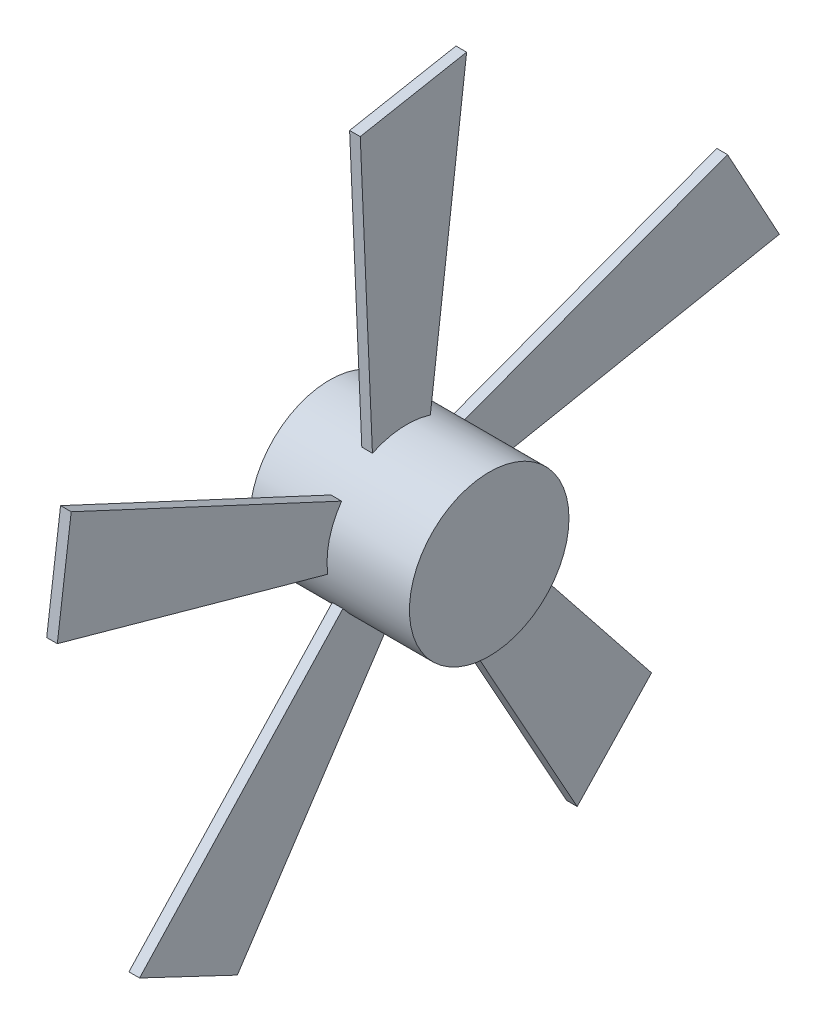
ISO-10303-21;
HEADER;
FILE_DESCRIPTION(('STEP AP214'),'2;1');
FILE_NAME('part.step','',(''),(''),'','','');
FILE_SCHEMA(('AUTOMOTIVE_DESIGN { 1 0 10303 214 1 1 1 1 }'));
ENDSEC;
DATA;
#1=APPLICATION_CONTEXT('core data for automotive mechanical design processes');
#2=APPLICATION_PROTOCOL_DEFINITION('international standard','automotive_design',2000,#1);
#3=PRODUCT_CONTEXT('',#1,'mechanical');
#4=PRODUCT('Part','Part','',(#3));
#5=PRODUCT_RELATED_PRODUCT_CATEGORY('part','',(#4));
#6=PRODUCT_DEFINITION_FORMATION('','',#4);
#7=PRODUCT_DEFINITION_CONTEXT('part definition',#1,'design');
#8=PRODUCT_DEFINITION('design','',#6,#7);
#9=PRODUCT_DEFINITION_SHAPE('','',#8);
#10=(LENGTH_UNIT() NAMED_UNIT(*) SI_UNIT(.MILLI.,.METRE.));
#11=(NAMED_UNIT(*) PLANE_ANGLE_UNIT() SI_UNIT($,.RADIAN.));
#12=(NAMED_UNIT(*) SI_UNIT($,.STERADIAN.) SOLID_ANGLE_UNIT());
#13=UNCERTAINTY_MEASURE_WITH_UNIT(LENGTH_MEASURE(1.E-05),#10,'distance_accuracy_value','');
#14=(GEOMETRIC_REPRESENTATION_CONTEXT(3) GLOBAL_UNCERTAINTY_ASSIGNED_CONTEXT((#13)) GLOBAL_UNIT_ASSIGNED_CONTEXT((#10,
#11,#12)) REPRESENTATION_CONTEXT('',''));
#15=CARTESIAN_POINT('',(0.,0.,0.));
#16=DIRECTION('',(0.,0.,1.));
#17=DIRECTION('',(1.,0.,0.));
#18=AXIS2_PLACEMENT_3D('',#15,#16,#17);
#19=CARTESIAN_POINT('',(30.48,0.,0.));
#20=DIRECTION('',(-1.,0.,0.));
#21=DIRECTION('',(0.,0.,1.));
#22=AXIS2_PLACEMENT_3D('',#19,#20,#21);
#23=CYLINDRICAL_SURFACE('',#22,15.24);
#24=CARTESIAN_POINT('',(14.732,0.,0.));
#25=DIRECTION('',(-1.,0.,0.));
#26=DIRECTION('',(0.,0.,1.));
#27=AXIS2_PLACEMENT_3D('',#24,#25,#26);
#28=CIRCLE('',#27,15.24);
#29=CARTESIAN_POINT('',(14.732,-7.27137485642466,-13.393457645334));
#30=VERTEX_POINT('',#29);
#31=CARTESIAN_POINT('',(14.732,-14.426123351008,-4.91371194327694));
#32=VERTEX_POINT('',#31);
#33=EDGE_CURVE('E392',#30,#32,#28,.T.);
#34=ORIENTED_EDGE('',*,*,#33,.F.);
#35=DIRECTION('',(-1.,0.,0.));
#36=VECTOR('',#35,1.);
#37=CARTESIAN_POINT('',(30.48,-7.27137485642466,-13.393457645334));
#38=LINE('',#37,#36);
#39=CARTESIAN_POINT('',(12.7,-7.27137485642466,-13.393457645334));
#40=VERTEX_POINT('',#39);
#41=EDGE_CURVE('E390',#40,#30,#38,.F.);
#42=ORIENTED_EDGE('',*,*,#41,.F.);
#43=CARTESIAN_POINT('',(12.7,0.,0.));
#44=DIRECTION('',(-1.,0.,0.));
#45=DIRECTION('',(0.,0.,1.));
#46=AXIS2_PLACEMENT_3D('',#43,#44,#45);
#47=CIRCLE('',#46,15.24);
#48=CARTESIAN_POINT('',(12.7,-14.426123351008,-4.91371194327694));
#49=VERTEX_POINT('',#48);
#50=EDGE_CURVE('E382',#40,#49,#47,.T.);
#51=ORIENTED_EDGE('',*,*,#50,.T.);
#52=DIRECTION('',(-1.,0.,0.));
#53=VECTOR('',#52,1.);
#54=CARTESIAN_POINT('',(30.48,-14.426123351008,-4.91371194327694));
#55=LINE('',#54,#53);
#56=EDGE_CURVE('E388',#32,#49,#55,.T.);
#57=ORIENTED_EDGE('',*,*,#56,.F.);
#58=EDGE_LOOP('',(#34,#42,#51,#57));
#59=FACE_BOUND('',#58,.T.);
#60=CARTESIAN_POINT('',(14.732,0.,0.));
#61=DIRECTION('',(-1.,0.,0.));
#62=DIRECTION('',(0.,0.,1.));
#63=AXIS2_PLACEMENT_3D('',#60,#61,#62);
#64=CIRCLE('',#63,15.24);
#65=CARTESIAN_POINT('',(14.732,-1.98981104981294,15.109541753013));
#66=VERTEX_POINT('',#65);
#67=CARTESIAN_POINT('',(14.732,8.78277153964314,12.4547390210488));
#68=VERTEX_POINT('',#67);
#69=EDGE_CURVE('E368',#66,#68,#64,.T.);
#70=ORIENTED_EDGE('',*,*,#69,.F.);
#71=DIRECTION('',(-1.,0.,0.));
#72=VECTOR('',#71,1.);
#73=CARTESIAN_POINT('',(30.48,-1.98981104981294,15.109541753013));
#74=LINE('',#73,#72);
#75=CARTESIAN_POINT('',(12.7,-1.98981104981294,15.109541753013));
#76=VERTEX_POINT('',#75);
#77=EDGE_CURVE('E356',#76,#66,#74,.F.);
#78=ORIENTED_EDGE('',*,*,#77,.F.);
#79=CARTESIAN_POINT('',(12.7,0.,0.));
#80=DIRECTION('',(-1.,0.,0.));
#81=DIRECTION('',(0.,0.,1.));
#82=AXIS2_PLACEMENT_3D('',#79,#80,#81);
#83=CIRCLE('',#82,15.24);
#84=CARTESIAN_POINT('',(12.7,8.78277153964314,12.4547390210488));
#85=VERTEX_POINT('',#84);
#86=EDGE_CURVE('E354',#76,#85,#83,.T.);
#87=ORIENTED_EDGE('',*,*,#86,.T.);
#88=DIRECTION('',(-1.,0.,0.));
#89=VECTOR('',#88,1.);
#90=CARTESIAN_POINT('',(30.48,8.78277153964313,12.4547390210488));
#91=LINE('',#90,#89);
#92=EDGE_CURVE('E362',#68,#85,#91,.T.);
#93=ORIENTED_EDGE('',*,*,#92,.F.);
#94=EDGE_LOOP('',(#70,#78,#87,#93));
#95=FACE_BOUND('',#94,.T.);
#96=CARTESIAN_POINT('',(0.,0.,0.));
#97=DIRECTION('',(1.,0.,0.));
#98=DIRECTION('',(0.,0.,-1.));
#99=AXIS2_PLACEMENT_3D('',#96,#97,#98);
#100=CIRCLE('',#99,15.24);
#101=CARTESIAN_POINT('',(0.,0.,-15.24));
#102=VERTEX_POINT('',#101);
#103=EDGE_CURVE('E334',#102,#102,#100,.T.);
#104=ORIENTED_EDGE('',*,*,#103,.T.);
#105=EDGE_LOOP('',(#104));
#106=FACE_BOUND('',#105,.T.);
#107=CARTESIAN_POINT('',(30.48,0.,0.));
#108=DIRECTION('',(1.,0.,0.));
#109=DIRECTION('',(0.,0.,-1.));
#110=AXIS2_PLACEMENT_3D('',#107,#108,#109);
#111=CIRCLE('',#110,15.24);
#112=CARTESIAN_POINT('',(30.48,0.,-15.24));
#113=VERTEX_POINT('',#112);
#114=EDGE_CURVE('E331',#113,#113,#111,.T.);
#115=ORIENTED_EDGE('',*,*,#114,.F.);
#116=EDGE_LOOP('',(#115));
#117=FACE_BOUND('',#116,.T.);
#118=CARTESIAN_POINT('',(14.732,0.,0.));
#119=DIRECTION('',(-1.,0.,0.));
#120=DIRECTION('',(0.,0.,1.));
#121=AXIS2_PLACEMENT_3D('',#118,#119,#120);
#122=CIRCLE('',#121,15.24);
#123=CARTESIAN_POINT('',(14.732,13.7551427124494,6.56152794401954));
#124=VERTEX_POINT('',#123);
#125=CARTESIAN_POINT('',(14.732,14.5591863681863,-4.50418608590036));
#126=VERTEX_POINT('',#125);
#127=EDGE_CURVE('E355',#124,#126,#122,.T.);
#128=ORIENTED_EDGE('',*,*,#127,.F.);
#129=DIRECTION('',(-1.,0.,0.));
#130=VECTOR('',#129,1.);
#131=CARTESIAN_POINT('',(30.48,13.7551427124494,6.56152794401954));
#132=LINE('',#131,#130);
#133=CARTESIAN_POINT('',(12.7,13.7551427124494,6.56152794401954));
#134=VERTEX_POINT('',#133);
#135=EDGE_CURVE('E344',#134,#124,#132,.F.);
#136=ORIENTED_EDGE('',*,*,#135,.F.);
#137=CARTESIAN_POINT('',(12.7,0.,0.));
#138=DIRECTION('',(-1.,0.,0.));
#139=DIRECTION('',(0.,0.,1.));
#140=AXIS2_PLACEMENT_3D('',#137,#138,#139);
#141=CIRCLE('',#140,15.24);
#142=CARTESIAN_POINT('',(12.7,14.5591863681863,-4.50418608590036));
#143=VERTEX_POINT('',#142);
#144=EDGE_CURVE('E337',#134,#143,#141,.T.);
#145=ORIENTED_EDGE('',*,*,#144,.T.);
#146=DIRECTION('',(-1.,0.,0.));
#147=VECTOR('',#146,1.);
#148=CARTESIAN_POINT('',(30.48,14.5591863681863,-4.50418608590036));
#149=LINE('',#148,#147);
#150=EDGE_CURVE('E346',#126,#143,#149,.T.);
#151=ORIENTED_EDGE('',*,*,#150,.F.);
#152=EDGE_LOOP('',(#128,#136,#145,#151));
#153=FACE_BOUND('',#152,.T.);
#154=CARTESIAN_POINT('',(14.732,0.,0.));
#155=DIRECTION('',(-1.,0.,0.));
#156=DIRECTION('',(0.,0.,1.));
#157=AXIS2_PLACEMENT_3D('',#154,#155,#156);
#158=CIRCLE('',#157,15.24);
#159=CARTESIAN_POINT('',(14.732,-14.9849135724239,2.77668241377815));
#160=VERTEX_POINT('',#159);
#161=CARTESIAN_POINT('',(14.732,-9.13113504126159,12.2016381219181));
#162=VERTEX_POINT('',#161);
#163=EDGE_CURVE('E379',#160,#162,#158,.T.);
#164=ORIENTED_EDGE('',*,*,#163,.F.);
#165=DIRECTION('',(-1.,0.,0.));
#166=VECTOR('',#165,1.);
#167=CARTESIAN_POINT('',(30.48,-14.9849135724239,2.77668241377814));
#168=LINE('',#167,#166);
#169=CARTESIAN_POINT('',(12.7,-14.9849135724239,2.77668241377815));
#170=VERTEX_POINT('',#169);
#171=EDGE_CURVE('E373',#170,#160,#168,.F.);
#172=ORIENTED_EDGE('',*,*,#171,.F.);
#173=CARTESIAN_POINT('',(12.7,0.,0.));
#174=DIRECTION('',(-1.,0.,0.));
#175=DIRECTION('',(0.,0.,1.));
#176=AXIS2_PLACEMENT_3D('',#173,#174,#175);
#177=CIRCLE('',#176,15.24);
#178=CARTESIAN_POINT('',(12.7,-9.13113504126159,12.2016381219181));
#179=VERTEX_POINT('',#178);
#180=EDGE_CURVE('E369',#170,#179,#177,.T.);
#181=ORIENTED_EDGE('',*,*,#180,.T.);
#182=DIRECTION('',(-1.,0.,0.));
#183=VECTOR('',#182,1.);
#184=CARTESIAN_POINT('',(30.48,-9.13113504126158,12.2016381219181));
#185=LINE('',#184,#183);
#186=EDGE_CURVE('E376',#162,#179,#185,.T.);
#187=ORIENTED_EDGE('',*,*,#186,.F.);
#188=EDGE_LOOP('',(#164,#172,#181,#187));
#189=FACE_BOUND('',#188,.T.);
#190=CARTESIAN_POINT('',(14.732,0.,0.));
#191=DIRECTION('',(-1.,0.,0.));
#192=DIRECTION('',(0.,0.,1.));
#193=AXIS2_PLACEMENT_3D('',#190,#191,#192);
#194=CIRCLE('',#193,15.24);
#195=CARTESIAN_POINT('',(14.732,10.4909567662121,-11.0542944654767));
#196=VERTEX_POINT('',#195);
#197=CARTESIAN_POINT('',(14.732,0.215300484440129,-15.2384791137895));
#198=VERTEX_POINT('',#197);
#199=EDGE_CURVE('E11',#196,#198,#194,.T.);
#200=ORIENTED_EDGE('',*,*,#199,.F.);
#201=DIRECTION('',(-1.,0.,0.));
#202=VECTOR('',#201,1.);
#203=CARTESIAN_POINT('',(30.48,10.4909567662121,-11.0542944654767));
#204=LINE('',#203,#202);
#205=CARTESIAN_POINT('',(12.7,10.4909567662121,-11.0542944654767));
#206=VERTEX_POINT('',#205);
#207=EDGE_CURVE('E399',#206,#196,#204,.F.);
#208=ORIENTED_EDGE('',*,*,#207,.F.);
#209=CARTESIAN_POINT('',(12.7,0.,0.));
#210=DIRECTION('',(-1.,0.,0.));
#211=DIRECTION('',(0.,0.,1.));
#212=AXIS2_PLACEMENT_3D('',#209,#210,#211);
#213=CIRCLE('',#212,15.24);
#214=CARTESIAN_POINT('',(12.7,0.215300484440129,-15.2384791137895));
#215=VERTEX_POINT('',#214);
#216=EDGE_CURVE('E398',#206,#215,#213,.T.);
#217=ORIENTED_EDGE('',*,*,#216,.T.);
#218=DIRECTION('',(-1.,0.,0.));
#219=VECTOR('',#218,1.);
#220=CARTESIAN_POINT('',(30.48,0.215300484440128,-15.2384791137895));
#221=LINE('',#220,#219);
#222=EDGE_CURVE('E54',#198,#215,#221,.T.);
#223=ORIENTED_EDGE('',*,*,#222,.F.);
#224=EDGE_LOOP('',(#200,#208,#217,#223));
#225=FACE_BOUND('',#224,.T.);
#226=ADVANCED_FACE('F50',(#59,#95,#106,#117,#153,#189,#225),#23,.T.);
#227=CARTESIAN_POINT('',(30.48,0.,0.));
#228=DIRECTION('',(1.,0.,0.));
#229=DIRECTION('',(0.,0.,-1.));
#230=AXIS2_PLACEMENT_3D('',#227,#228,#229);
#231=PLANE('',#230);
#232=ORIENTED_EDGE('',*,*,#114,.T.);
#233=EDGE_LOOP('',(#232));
#234=FACE_BOUND('',#233,.T.);
#235=ADVANCED_FACE('F425',(#234),#231,.T.);
#236=CARTESIAN_POINT('',(0.,0.,0.));
#237=DIRECTION('',(1.,0.,0.));
#238=DIRECTION('',(0.,0.,-1.));
#239=AXIS2_PLACEMENT_3D('',#236,#237,#238);
#240=PLANE('',#239);
#241=ORIENTED_EDGE('',*,*,#103,.F.);
#242=EDGE_LOOP('',(#241));
#243=FACE_BOUND('',#242,.T.);
#244=ADVANCED_FACE('F427',(#243),#240,.F.);
#245=CARTESIAN_POINT('',(14.732,8.89,-3.81));
#246=DIRECTION('',(0.,0.121541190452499,0.992586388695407));
#247=DIRECTION('',(0.,-0.992586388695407,0.121541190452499));
#248=AXIS2_PLACEMENT_3D('',#245,#246,#247);
#249=PLANE('',#248);
#250=DIRECTION('',(0.,0.992586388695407,-0.121541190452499));
#251=VECTOR('',#250,1.);
#252=CARTESIAN_POINT('',(14.732,8.89,-3.81));
#253=LINE('',#252,#251);
#254=CARTESIAN_POINT('',(14.732,71.12,-11.43));
#255=VERTEX_POINT('',#254);
#256=EDGE_CURVE('E308',#126,#255,#253,.T.);
#257=ORIENTED_EDGE('',*,*,#256,.F.);
#258=ORIENTED_EDGE('',*,*,#150,.T.);
#259=DIRECTION('',(0.,0.992586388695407,-0.121541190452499));
#260=VECTOR('',#259,1.);
#261=CARTESIAN_POINT('',(12.7,8.89,-3.81));
#262=LINE('',#261,#260);
#263=CARTESIAN_POINT('',(12.7,71.12,-11.43));
#264=VERTEX_POINT('',#263);
#265=EDGE_CURVE('E303',#143,#264,#262,.T.);
#266=ORIENTED_EDGE('',*,*,#265,.T.);
#267=DIRECTION('',(-1.,0.,0.));
#268=VECTOR('',#267,1.);
#269=CARTESIAN_POINT('',(14.732,71.12,-11.43));
#270=LINE('',#269,#268);
#271=EDGE_CURVE('E328',#255,#264,#270,.T.);
#272=ORIENTED_EDGE('',*,*,#271,.F.);
#273=EDGE_LOOP('',(#257,#258,#266,#272));
#274=FACE_BOUND('',#273,.T.);
#275=ADVANCED_FACE('F518',(#274),#249,.F.);
#276=CARTESIAN_POINT('',(14.732,67.31,8.89));
#277=DIRECTION('',(0.,0.0434372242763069,-0.99905615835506));
#278=DIRECTION('',(0.,0.99905615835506,0.0434372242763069));
#279=AXIS2_PLACEMENT_3D('',#276,#277,#278);
#280=PLANE('',#279);
#281=DIRECTION('',(0.,-0.99905615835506,-0.0434372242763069));
#282=VECTOR('',#281,1.);
#283=CARTESIAN_POINT('',(12.7,67.31,8.89));
#284=LINE('',#283,#282);
#285=CARTESIAN_POINT('',(12.7,67.31,8.89));
#286=VERTEX_POINT('',#285);
#287=EDGE_CURVE('E309',#286,#134,#284,.T.);
#288=ORIENTED_EDGE('',*,*,#287,.T.);
#289=ORIENTED_EDGE('',*,*,#135,.T.);
#290=DIRECTION('',(0.,-0.99905615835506,-0.0434372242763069));
#291=VECTOR('',#290,1.);
#292=CARTESIAN_POINT('',(14.732,67.31,8.89));
#293=LINE('',#292,#291);
#294=CARTESIAN_POINT('',(14.732,67.31,8.89));
#295=VERTEX_POINT('',#294);
#296=EDGE_CURVE('E311',#295,#124,#293,.T.);
#297=ORIENTED_EDGE('',*,*,#296,.F.);
#298=DIRECTION('',(-1.,0.,0.));
#299=VECTOR('',#298,1.);
#300=CARTESIAN_POINT('',(14.732,67.31,8.89));
#301=LINE('',#300,#299);
#302=EDGE_CURVE('E320',#295,#286,#301,.T.);
#303=ORIENTED_EDGE('',*,*,#302,.T.);
#304=EDGE_LOOP('',(#288,#289,#297,#303));
#305=FACE_BOUND('',#304,.T.);
#306=ADVANCED_FACE('F516',(#305),#280,.F.);
#307=CARTESIAN_POINT('',(14.732,71.12,-11.43));
#308=DIRECTION('',(0.,-0.982872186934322,-0.184288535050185));
#309=DIRECTION('',(0.,0.184288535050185,-0.982872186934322));
#310=AXIS2_PLACEMENT_3D('',#307,#308,#309);
#311=PLANE('',#310);
#312=DIRECTION('',(0.,-0.184288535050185,0.982872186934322));
#313=VECTOR('',#312,1.);
#314=CARTESIAN_POINT('',(12.7,71.12,-11.43));
#315=LINE('',#314,#313);
#316=EDGE_CURVE('E319',#264,#286,#315,.T.);
#317=ORIENTED_EDGE('',*,*,#316,.T.);
#318=ORIENTED_EDGE('',*,*,#302,.F.);
#319=DIRECTION('',(0.,-0.184288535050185,0.982872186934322));
#320=VECTOR('',#319,1.);
#321=CARTESIAN_POINT('',(14.732,71.12,-11.43));
#322=LINE('',#321,#320);
#323=EDGE_CURVE('E310',#255,#295,#322,.T.);
#324=ORIENTED_EDGE('',*,*,#323,.F.);
#325=ORIENTED_EDGE('',*,*,#271,.T.);
#326=EDGE_LOOP('',(#317,#318,#324,#325));
#327=FACE_BOUND('',#326,.T.);
#328=ADVANCED_FACE('F512',(#327),#311,.F.);
#329=CARTESIAN_POINT('',(14.732,0.,0.));
#330=DIRECTION('',(-1.,0.,0.));
#331=DIRECTION('',(0.,0.,1.));
#332=AXIS2_PLACEMENT_3D('',#329,#330,#331);
#333=PLANE('',#332);
#334=ORIENTED_EDGE('',*,*,#296,.T.);
#335=ORIENTED_EDGE('',*,*,#127,.T.);
#336=ORIENTED_EDGE('',*,*,#256,.T.);
#337=ORIENTED_EDGE('',*,*,#323,.T.);
#338=EDGE_LOOP('',(#334,#335,#336,#337));
#339=FACE_BOUND('',#338,.T.);
#340=ADVANCED_FACE('F506',(#339),#333,.F.);
#341=CARTESIAN_POINT('',(12.7,0.,0.));
#342=DIRECTION('',(-1.,0.,0.));
#343=DIRECTION('',(0.,0.,1.));
#344=AXIS2_PLACEMENT_3D('',#341,#342,#343);
#345=PLANE('',#344);
#346=ORIENTED_EDGE('',*,*,#144,.F.);
#347=ORIENTED_EDGE('',*,*,#287,.F.);
#348=ORIENTED_EDGE('',*,*,#316,.F.);
#349=ORIENTED_EDGE('',*,*,#265,.F.);
#350=EDGE_LOOP('',(#346,#347,#348,#349));
#351=FACE_BOUND('',#350,.T.);
#352=ADVANCED_FACE('F508',(#351),#345,.T.);
#353=CARTESIAN_POINT('',(14.732,6.37068640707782,7.27753768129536));
#354=DIRECTION('',(0.,-0.906447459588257,0.422318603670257));
#355=DIRECTION('',(0.,-0.422318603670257,-0.906447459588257));
#356=AXIS2_PLACEMENT_3D('',#353,#354,#355);
#357=PLANE('',#356);
#358=DIRECTION('',(0.,0.422318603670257,0.906447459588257));
#359=VECTOR('',#358,1.);
#360=CARTESIAN_POINT('',(14.732,6.37068640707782,7.27753768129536));
#361=LINE('',#360,#359);
#362=CARTESIAN_POINT('',(14.732,32.8478646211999,64.1070751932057));
#363=VERTEX_POINT('',#362);
#364=EDGE_CURVE('E279',#68,#363,#361,.T.);
#365=ORIENTED_EDGE('',*,*,#364,.F.);
#366=ORIENTED_EDGE('',*,*,#92,.T.);
#367=DIRECTION('',(0.,0.422318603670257,0.906447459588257));
#368=VECTOR('',#367,1.);
#369=CARTESIAN_POINT('',(12.7,6.37068640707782,7.27753768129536));
#370=LINE('',#369,#368);
#371=CARTESIAN_POINT('',(12.7,32.8478646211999,64.1070751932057));
#372=VERTEX_POINT('',#371);
#373=EDGE_CURVE('E280',#85,#372,#370,.T.);
#374=ORIENTED_EDGE('',*,*,#373,.T.);
#375=DIRECTION('',(-1.,0.,0.));
#376=VECTOR('',#375,1.);
#377=CARTESIAN_POINT('',(14.732,32.8478646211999,64.1070751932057));
#378=LINE('',#377,#376);
#379=EDGE_CURVE('E302',#363,#372,#378,.T.);
#380=ORIENTED_EDGE('',*,*,#379,.F.);
#381=EDGE_LOOP('',(#365,#366,#374,#380));
#382=FACE_BOUND('',#381,.T.);
#383=ADVANCED_FACE('F496',(#382),#357,.F.);
#384=CARTESIAN_POINT('',(14.732,12.3450414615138,66.7627751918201));
#385=DIRECTION('',(0.,0.963581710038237,-0.267414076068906));
#386=DIRECTION('',(0.,0.267414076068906,0.963581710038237));
#387=AXIS2_PLACEMENT_3D('',#384,#385,#386);
#388=PLANE('',#387);
#389=DIRECTION('',(0.,-0.267414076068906,-0.963581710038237));
#390=VECTOR('',#389,1.);
#391=CARTESIAN_POINT('',(12.7,12.3450414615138,66.7627751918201));
#392=LINE('',#391,#390);
#393=CARTESIAN_POINT('',(12.7,12.3450414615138,66.7627751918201));
#394=VERTEX_POINT('',#393);
#395=EDGE_CURVE('E285',#394,#76,#392,.T.);
#396=ORIENTED_EDGE('',*,*,#395,.T.);
#397=ORIENTED_EDGE('',*,*,#77,.T.);
#398=DIRECTION('',(0.,-0.267414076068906,-0.963581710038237));
#399=VECTOR('',#398,1.);
#400=CARTESIAN_POINT('',(14.732,12.3450414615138,66.7627751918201));
#401=LINE('',#400,#399);
#402=CARTESIAN_POINT('',(14.732,12.3450414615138,66.7627751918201));
#403=VERTEX_POINT('',#402);
#404=EDGE_CURVE('E284',#403,#66,#401,.T.);
#405=ORIENTED_EDGE('',*,*,#404,.F.);
#406=DIRECTION('',(-1.,0.,0.));
#407=VECTOR('',#406,1.);
#408=CARTESIAN_POINT('',(14.732,12.3450414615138,66.7627751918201));
#409=LINE('',#408,#407);
#410=EDGE_CURVE('E287',#403,#394,#409,.T.);
#411=ORIENTED_EDGE('',*,*,#410,.T.);
#412=EDGE_LOOP('',(#396,#397,#405,#411));
#413=FACE_BOUND('',#412,.T.);
#414=ADVANCED_FACE('F497',(#413),#388,.F.);
#415=CARTESIAN_POINT('',(14.732,32.8478646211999,64.1070751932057));
#416=DIRECTION('',(0.,-0.128455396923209,-0.991715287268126));
#417=DIRECTION('',(0.,0.991715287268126,-0.128455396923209));
#418=AXIS2_PLACEMENT_3D('',#415,#416,#417);
#419=PLANE('',#418);
#420=DIRECTION('',(0.,-0.991715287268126,0.128455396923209));
#421=VECTOR('',#420,1.);
#422=CARTESIAN_POINT('',(12.7,32.8478646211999,64.1070751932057));
#423=LINE('',#422,#421);
#424=EDGE_CURVE('E295',#372,#394,#423,.T.);
#425=ORIENTED_EDGE('',*,*,#424,.T.);
#426=ORIENTED_EDGE('',*,*,#410,.F.);
#427=DIRECTION('',(0.,-0.991715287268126,0.128455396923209));
#428=VECTOR('',#427,1.);
#429=CARTESIAN_POINT('',(14.732,32.8478646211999,64.1070751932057));
#430=LINE('',#429,#428);
#431=EDGE_CURVE('E281',#363,#403,#430,.T.);
#432=ORIENTED_EDGE('',*,*,#431,.F.);
#433=ORIENTED_EDGE('',*,*,#379,.T.);
#434=EDGE_LOOP('',(#425,#426,#432,#433));
#435=FACE_BOUND('',#434,.T.);
#436=ADVANCED_FACE('F491',(#435),#419,.F.);
#437=CARTESIAN_POINT('',(14.732,0.,0.));
#438=DIRECTION('',(-1.,0.,0.));
#439=DIRECTION('',(0.,0.,1.));
#440=AXIS2_PLACEMENT_3D('',#437,#438,#439);
#441=PLANE('',#440);
#442=ORIENTED_EDGE('',*,*,#404,.T.);
#443=ORIENTED_EDGE('',*,*,#69,.T.);
#444=ORIENTED_EDGE('',*,*,#364,.T.);
#445=ORIENTED_EDGE('',*,*,#431,.T.);
#446=EDGE_LOOP('',(#442,#443,#444,#445));
#447=FACE_BOUND('',#446,.T.);
#448=ADVANCED_FACE('F488',(#447),#441,.F.);
#449=CARTESIAN_POINT('',(12.7,0.,0.));
#450=DIRECTION('',(-1.,0.,0.));
#451=DIRECTION('',(0.,0.,1.));
#452=AXIS2_PLACEMENT_3D('',#449,#450,#451);
#453=PLANE('',#452);
#454=ORIENTED_EDGE('',*,*,#86,.F.);
#455=ORIENTED_EDGE('',*,*,#395,.F.);
#456=ORIENTED_EDGE('',*,*,#424,.F.);
#457=ORIENTED_EDGE('',*,*,#373,.F.);
#458=EDGE_LOOP('',(#454,#455,#456,#457));
#459=FACE_BOUND('',#458,.T.);
#460=ADVANCED_FACE('F490',(#459),#453,.T.);
#461=CARTESIAN_POINT('',(14.732,-4.95269926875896,8.30776564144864));
#462=DIRECTION('',(0.,-0.681756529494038,-0.731579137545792));
#463=DIRECTION('',(0.,0.731579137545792,-0.681756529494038));
#464=AXIS2_PLACEMENT_3D('',#461,#462,#463);
#465=PLANE('',#464);
#466=DIRECTION('',(0.,-0.731579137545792,0.681756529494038));
#467=VECTOR('',#466,1.);
#468=CARTESIAN_POINT('',(14.732,-4.95269926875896,8.30776564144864));
#469=LINE('',#468,#467);
#470=CARTESIAN_POINT('',(14.732,-50.8189032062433,51.0503513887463));
#471=VERTEX_POINT('',#470);
#472=EDGE_CURVE('E248',#162,#471,#469,.T.);
#473=ORIENTED_EDGE('',*,*,#472,.F.);
#474=ORIENTED_EDGE('',*,*,#186,.T.);
#475=DIRECTION('',(0.,-0.731579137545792,0.681756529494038));
#476=VECTOR('',#475,1.);
#477=CARTESIAN_POINT('',(12.7,-4.95269926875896,8.30776564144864));
#478=LINE('',#477,#476);
#479=CARTESIAN_POINT('',(12.7,-50.8189032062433,51.0503513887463));
#480=VERTEX_POINT('',#479);
#481=EDGE_CURVE('E246',#179,#480,#478,.T.);
#482=ORIENTED_EDGE('',*,*,#481,.T.);
#483=DIRECTION('',(-1.,0.,0.));
#484=VECTOR('',#483,1.);
#485=CARTESIAN_POINT('',(14.732,-50.8189032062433,51.0503513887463));
#486=LINE('',#485,#484);
#487=EDGE_CURVE('E272',#471,#480,#486,.T.);
#488=ORIENTED_EDGE('',*,*,#487,.F.);
#489=EDGE_LOOP('',(#473,#474,#482,#488));
#490=FACE_BOUND('',#489,.T.);
#491=ADVANCED_FACE('F460',(#490),#465,.F.);
#492=CARTESIAN_POINT('',(14.732,-59.6803447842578,32.3716642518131));
#493=DIRECTION('',(0.,0.552089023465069,0.833785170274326));
#494=DIRECTION('',(0.,-0.833785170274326,0.552089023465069));
#495=AXIS2_PLACEMENT_3D('',#492,#493,#494);
#496=PLANE('',#495);
#497=DIRECTION('',(0.,0.833785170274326,-0.552089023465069));
#498=VECTOR('',#497,1.);
#499=CARTESIAN_POINT('',(12.7,-59.6803447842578,32.3716642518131));
#500=LINE('',#499,#498);
#501=CARTESIAN_POINT('',(12.7,-59.6803447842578,32.3716642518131));
#502=VERTEX_POINT('',#501);
#503=EDGE_CURVE('E255',#502,#170,#500,.T.);
#504=ORIENTED_EDGE('',*,*,#503,.T.);
#505=ORIENTED_EDGE('',*,*,#171,.T.);
#506=DIRECTION('',(0.,0.833785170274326,-0.552089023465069));
#507=VECTOR('',#506,1.);
#508=CARTESIAN_POINT('',(14.732,-59.6803447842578,32.3716642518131));
#509=LINE('',#508,#507);
#510=CARTESIAN_POINT('',(14.732,-59.6803447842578,32.3716642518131));
#511=VERTEX_POINT('',#510);
#512=EDGE_CURVE('E260',#511,#160,#509,.T.);
#513=ORIENTED_EDGE('',*,*,#512,.F.);
#514=DIRECTION('',(-1.,0.,0.));
#515=VECTOR('',#514,1.);
#516=CARTESIAN_POINT('',(14.732,-59.6803447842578,32.3716642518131));
#517=LINE('',#516,#515);
#518=EDGE_CURVE('E261',#511,#502,#517,.T.);
#519=ORIENTED_EDGE('',*,*,#518,.T.);
#520=EDGE_LOOP('',(#504,#505,#513,#519));
#521=FACE_BOUND('',#520,.T.);
#522=ADVANCED_FACE('F464',(#521),#496,.F.);
#523=CARTESIAN_POINT('',(14.732,-50.8189032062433,51.0503513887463));
#524=DIRECTION('',(0.,0.90348238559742,-0.428625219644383));
#525=DIRECTION('',(0.,0.428625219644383,0.90348238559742));
#526=AXIS2_PLACEMENT_3D('',#523,#524,#525);
#527=PLANE('',#526);
#528=DIRECTION('',(0.,-0.428625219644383,-0.90348238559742));
#529=VECTOR('',#528,1.);
#530=CARTESIAN_POINT('',(12.7,-50.8189032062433,51.0503513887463));
#531=LINE('',#530,#529);
#532=EDGE_CURVE('E262',#480,#502,#531,.T.);
#533=ORIENTED_EDGE('',*,*,#532,.T.);
#534=ORIENTED_EDGE('',*,*,#518,.F.);
#535=DIRECTION('',(0.,-0.428625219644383,-0.90348238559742));
#536=VECTOR('',#535,1.);
#537=CARTESIAN_POINT('',(14.732,-50.8189032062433,51.0503513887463));
#538=LINE('',#537,#536);
#539=EDGE_CURVE('E251',#471,#511,#538,.T.);
#540=ORIENTED_EDGE('',*,*,#539,.F.);
#541=ORIENTED_EDGE('',*,*,#487,.T.);
#542=EDGE_LOOP('',(#533,#534,#540,#541));
#543=FACE_BOUND('',#542,.T.);
#544=ADVANCED_FACE('F465',(#543),#527,.F.);
#545=CARTESIAN_POINT('',(14.732,0.,0.));
#546=DIRECTION('',(-1.,0.,0.));
#547=DIRECTION('',(0.,0.,1.));
#548=AXIS2_PLACEMENT_3D('',#545,#546,#547);
#549=PLANE('',#548);
#550=ORIENTED_EDGE('',*,*,#512,.T.);
#551=ORIENTED_EDGE('',*,*,#163,.T.);
#552=ORIENTED_EDGE('',*,*,#472,.T.);
#553=ORIENTED_EDGE('',*,*,#539,.T.);
#554=EDGE_LOOP('',(#550,#551,#552,#553));
#555=FACE_BOUND('',#554,.T.);
#556=ADVANCED_FACE('F451',(#555),#549,.F.);
#557=CARTESIAN_POINT('',(12.7,0.,0.));
#558=DIRECTION('',(-1.,0.,0.));
#559=DIRECTION('',(0.,0.,1.));
#560=AXIS2_PLACEMENT_3D('',#557,#558,#559);
#561=PLANE('',#560);
#562=ORIENTED_EDGE('',*,*,#180,.F.);
#563=ORIENTED_EDGE('',*,*,#503,.F.);
#564=ORIENTED_EDGE('',*,*,#532,.F.);
#565=ORIENTED_EDGE('',*,*,#481,.F.);
#566=EDGE_LOOP('',(#562,#563,#564,#565));
#567=FACE_BOUND('',#566,.T.);
#568=ADVANCED_FACE('F469',(#567),#561,.T.);
#569=CARTESIAN_POINT('',(14.732,-9.43162289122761,-2.14305614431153));
#570=DIRECTION('',(0.,0.485098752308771,-0.874459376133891));
#571=DIRECTION('',(0.,0.874459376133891,0.485098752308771));
#572=AXIS2_PLACEMENT_3D('',#569,#570,#571);
#573=PLANE('',#572);
#574=DIRECTION('',(0.,-0.874459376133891,-0.485098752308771));
#575=VECTOR('',#574,1.);
#576=CARTESIAN_POINT('',(14.732,-9.43162289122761,-2.14305614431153));
#577=LINE('',#576,#575);
#578=CARTESIAN_POINT('',(14.732,-64.2556740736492,-32.556222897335));
#579=VERTEX_POINT('',#578);
#580=EDGE_CURVE('E225',#32,#579,#577,.T.);
#581=ORIENTED_EDGE('',*,*,#580,.F.);
#582=ORIENTED_EDGE('',*,*,#56,.T.);
#583=DIRECTION('',(0.,-0.874459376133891,-0.485098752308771));
#584=VECTOR('',#583,1.);
#585=CARTESIAN_POINT('',(12.7,-9.43162289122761,-2.14305614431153));
#586=LINE('',#585,#584);
#587=CARTESIAN_POINT('',(12.7,-64.2556740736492,-32.556222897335));
#588=VERTEX_POINT('',#587);
#589=EDGE_CURVE('E69',#49,#588,#586,.T.);
#590=ORIENTED_EDGE('',*,*,#589,.T.);
#591=DIRECTION('',(-1.,0.,0.));
#592=VECTOR('',#591,1.);
#593=CARTESIAN_POINT('',(14.732,-64.2556740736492,-32.556222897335));
#594=LINE('',#593,#592);
#595=EDGE_CURVE('E244',#579,#588,#594,.T.);
#596=ORIENTED_EDGE('',*,*,#595,.F.);
#597=EDGE_LOOP('',(#581,#582,#590,#596));
#598=FACE_BOUND('',#597,.T.);
#599=ADVANCED_FACE('F466',(#598),#573,.F.);
#600=CARTESIAN_POINT('',(14.732,-49.2295229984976,-46.7559864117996));
#601=DIRECTION('',(0.,-0.622371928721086,0.782721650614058));
#602=DIRECTION('',(0.,-0.782721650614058,-0.622371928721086));
#603=AXIS2_PLACEMENT_3D('',#600,#601,#602);
#604=PLANE('',#603);
#605=DIRECTION('',(0.,0.782721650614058,0.622371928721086));
#606=VECTOR('',#605,1.);
#607=CARTESIAN_POINT('',(12.7,-49.2295229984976,-46.7559864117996));
#608=LINE('',#607,#606);
#609=CARTESIAN_POINT('',(12.7,-49.2295229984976,-46.7559864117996));
#610=VERTEX_POINT('',#609);
#611=EDGE_CURVE('E226',#610,#40,#608,.T.);
#612=ORIENTED_EDGE('',*,*,#611,.T.);
#613=ORIENTED_EDGE('',*,*,#41,.T.);
#614=DIRECTION('',(0.,0.782721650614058,0.622371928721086));
#615=VECTOR('',#614,1.);
#616=CARTESIAN_POINT('',(14.732,-49.2295229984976,-46.7559864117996));
#617=LINE('',#616,#615);
#618=CARTESIAN_POINT('',(14.732,-49.2295229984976,-46.7559864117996));
#619=VERTEX_POINT('',#618);
#620=EDGE_CURVE('E228',#619,#30,#617,.T.);
#621=ORIENTED_EDGE('',*,*,#620,.F.);
#622=DIRECTION('',(-1.,0.,0.));
#623=VECTOR('',#622,1.);
#624=CARTESIAN_POINT('',(14.732,-49.2295229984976,-46.7559864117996));
#625=LINE('',#624,#623);
#626=EDGE_CURVE('E231',#619,#610,#625,.T.);
#627=ORIENTED_EDGE('',*,*,#626,.T.);
#628=EDGE_LOOP('',(#612,#613,#621,#627));
#629=FACE_BOUND('',#628,.T.);
#630=ADVANCED_FACE('F478',(#629),#604,.F.);
#631=CARTESIAN_POINT('',(14.732,-64.2556740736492,-32.556222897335));
#632=DIRECTION('',(0.,0.686838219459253,0.726810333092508));
#633=DIRECTION('',(0.,-0.726810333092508,0.686838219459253));
#634=AXIS2_PLACEMENT_3D('',#631,#632,#633);
#635=PLANE('',#634);
#636=DIRECTION('',(0.,0.726810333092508,-0.686838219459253));
#637=VECTOR('',#636,1.);
#638=CARTESIAN_POINT('',(12.7,-64.2556740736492,-32.556222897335));
#639=LINE('',#638,#637);
#640=EDGE_CURVE('E237',#588,#610,#639,.T.);
#641=ORIENTED_EDGE('',*,*,#640,.T.);
#642=ORIENTED_EDGE('',*,*,#626,.F.);
#643=DIRECTION('',(0.,0.726810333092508,-0.686838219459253));
#644=VECTOR('',#643,1.);
#645=CARTESIAN_POINT('',(14.732,-64.2556740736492,-32.556222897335));
#646=LINE('',#645,#644);
#647=EDGE_CURVE('E223',#579,#619,#646,.T.);
#648=ORIENTED_EDGE('',*,*,#647,.F.);
#649=ORIENTED_EDGE('',*,*,#595,.T.);
#650=EDGE_LOOP('',(#641,#642,#648,#649));
#651=FACE_BOUND('',#650,.T.);
#652=ADVANCED_FACE('F599',(#651),#635,.F.);
#653=CARTESIAN_POINT('',(14.732,0.,0.));
#654=DIRECTION('',(-1.,0.,0.));
#655=DIRECTION('',(0.,0.,1.));
#656=AXIS2_PLACEMENT_3D('',#653,#654,#655);
#657=PLANE('',#656);
#658=ORIENTED_EDGE('',*,*,#620,.T.);
#659=ORIENTED_EDGE('',*,*,#33,.T.);
#660=ORIENTED_EDGE('',*,*,#580,.T.);
#661=ORIENTED_EDGE('',*,*,#647,.T.);
#662=EDGE_LOOP('',(#658,#659,#660,#661));
#663=FACE_BOUND('',#662,.T.);
#664=ADVANCED_FACE('F609',(#663),#657,.F.);
#665=CARTESIAN_POINT('',(12.7,0.,0.));
#666=DIRECTION('',(-1.,0.,0.));
#667=DIRECTION('',(0.,0.,1.));
#668=AXIS2_PLACEMENT_3D('',#665,#666,#667);
#669=PLANE('',#668);
#670=ORIENTED_EDGE('',*,*,#50,.F.);
#671=ORIENTED_EDGE('',*,*,#611,.F.);
#672=ORIENTED_EDGE('',*,*,#640,.F.);
#673=ORIENTED_EDGE('',*,*,#589,.F.);
#674=EDGE_LOOP('',(#670,#671,#672,#673));
#675=FACE_BOUND('',#674,.T.);
#676=ADVANCED_FACE('F416',(#675),#669,.T.);
#677=CARTESIAN_POINT('',(14.732,-0.876364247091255,-9.63224717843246));
#678=DIRECTION('',(0.,0.981564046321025,0.191133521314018));
#679=DIRECTION('',(0.,-0.191133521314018,0.981564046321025));
#680=AXIS2_PLACEMENT_3D('',#677,#678,#679);
#681=PLANE('',#680);
#682=DIRECTION('',(0.,0.191133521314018,-0.981564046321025));
#683=VECTOR('',#682,1.);
#684=CARTESIAN_POINT('',(14.732,-0.876364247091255,-9.63224717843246));
#685=LINE('',#684,#683);
#686=CARTESIAN_POINT('',(14.732,11.1067126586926,-71.171203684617));
#687=VERTEX_POINT('',#686);
#688=EDGE_CURVE('E185',#198,#687,#685,.T.);
#689=ORIENTED_EDGE('',*,*,#688,.F.);
#690=ORIENTED_EDGE('',*,*,#222,.T.);
#691=DIRECTION('',(0.,0.191133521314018,-0.981564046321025));
#692=VECTOR('',#691,1.);
#693=CARTESIAN_POINT('',(12.7,-0.876364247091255,-9.63224717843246));
#694=LINE('',#693,#692);
#695=CARTESIAN_POINT('',(12.7,11.1067126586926,-71.171203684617));
#696=VERTEX_POINT('',#695);
#697=EDGE_CURVE('E65',#215,#696,#694,.T.);
#698=ORIENTED_EDGE('',*,*,#697,.T.);
#699=DIRECTION('',(-1.,0.,0.));
#700=VECTOR('',#699,1.);
#701=CARTESIAN_POINT('',(14.732,11.1067126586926,-71.171203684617));
#702=LINE('',#701,#700);
#703=EDGE_CURVE('E198',#687,#696,#702,.T.);
#704=ORIENTED_EDGE('',*,*,#703,.F.);
#705=EDGE_LOOP('',(#689,#690,#698,#704));
#706=FACE_BOUND('',#705,.T.);
#707=ADVANCED_FACE('F197',(#706),#681,.F.);
#708=CARTESIAN_POINT('',(14.732,29.2548263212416,-61.2684530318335));
#709=DIRECTION('',(0.,-0.936736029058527,-0.350036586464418));
#710=DIRECTION('',(0.,0.350036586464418,-0.936736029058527));
#711=AXIS2_PLACEMENT_3D('',#708,#709,#710);
#712=PLANE('',#711);
#713=DIRECTION('',(0.,-0.350036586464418,0.936736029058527));
#714=VECTOR('',#713,1.);
#715=CARTESIAN_POINT('',(12.7,29.2548263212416,-61.2684530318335));
#716=LINE('',#715,#714);
#717=CARTESIAN_POINT('',(12.7,29.2548263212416,-61.2684530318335));
#718=VERTEX_POINT('',#717);
#719=EDGE_CURVE('E195',#718,#206,#716,.T.);
#720=ORIENTED_EDGE('',*,*,#719,.T.);
#721=ORIENTED_EDGE('',*,*,#207,.T.);
#722=DIRECTION('',(0.,-0.350036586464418,0.936736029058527));
#723=VECTOR('',#722,1.);
#724=CARTESIAN_POINT('',(14.732,29.2548263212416,-61.2684530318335));
#725=LINE('',#724,#723);
#726=CARTESIAN_POINT('',(14.732,29.2548263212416,-61.2684530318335));
#727=VERTEX_POINT('',#726);
#728=EDGE_CURVE('E206',#727,#196,#725,.T.);
#729=ORIENTED_EDGE('',*,*,#728,.F.);
#730=DIRECTION('',(-1.,0.,0.));
#731=VECTOR('',#730,1.);
#732=CARTESIAN_POINT('',(14.732,29.2548263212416,-61.2684530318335));
#733=LINE('',#732,#731);
#734=EDGE_CURVE('E199',#727,#718,#733,.T.);
#735=ORIENTED_EDGE('',*,*,#734,.T.);
#736=EDGE_LOOP('',(#720,#721,#729,#735));
#737=FACE_BOUND('',#736,.T.);
#738=ADVANCED_FACE('F408',(#737),#712,.F.);
#739=CARTESIAN_POINT('',(14.732,11.1067126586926,-71.171203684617));
#740=DIRECTION('',(0.,-0.478993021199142,0.877818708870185));
#741=DIRECTION('',(0.,-0.877818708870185,-0.478993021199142));
#742=AXIS2_PLACEMENT_3D('',#739,#740,#741);
#743=PLANE('',#742);
#744=DIRECTION('',(0.,0.877818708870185,0.478993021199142));
#745=VECTOR('',#744,1.);
#746=CARTESIAN_POINT('',(12.7,11.1067126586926,-71.171203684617));
#747=LINE('',#746,#745);
#748=EDGE_CURVE('E212',#696,#718,#747,.T.);
#749=ORIENTED_EDGE('',*,*,#748,.T.);
#750=ORIENTED_EDGE('',*,*,#734,.F.);
#751=DIRECTION('',(0.,0.877818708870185,0.478993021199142));
#752=VECTOR('',#751,1.);
#753=CARTESIAN_POINT('',(14.732,11.1067126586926,-71.171203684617));
#754=LINE('',#753,#752);
#755=EDGE_CURVE('E190',#687,#727,#754,.T.);
#756=ORIENTED_EDGE('',*,*,#755,.F.);
#757=ORIENTED_EDGE('',*,*,#703,.T.);
#758=EDGE_LOOP('',(#749,#750,#756,#757));
#759=FACE_BOUND('',#758,.T.);
#760=ADVANCED_FACE('F205',(#759),#743,.F.);
#761=CARTESIAN_POINT('',(14.732,0.,0.));
#762=DIRECTION('',(-1.,0.,0.));
#763=DIRECTION('',(0.,0.,1.));
#764=AXIS2_PLACEMENT_3D('',#761,#762,#763);
#765=PLANE('',#764);
#766=ORIENTED_EDGE('',*,*,#728,.T.);
#767=ORIENTED_EDGE('',*,*,#199,.T.);
#768=ORIENTED_EDGE('',*,*,#688,.T.);
#769=ORIENTED_EDGE('',*,*,#755,.T.);
#770=EDGE_LOOP('',(#766,#767,#768,#769));
#771=FACE_BOUND('',#770,.T.);
#772=ADVANCED_FACE('F183',(#771),#765,.F.);
#773=CARTESIAN_POINT('',(12.7,0.,0.));
#774=DIRECTION('',(-1.,0.,0.));
#775=DIRECTION('',(0.,0.,1.));
#776=AXIS2_PLACEMENT_3D('',#773,#774,#775);
#777=PLANE('',#776);
#778=ORIENTED_EDGE('',*,*,#216,.F.);
#779=ORIENTED_EDGE('',*,*,#719,.F.);
#780=ORIENTED_EDGE('',*,*,#748,.F.);
#781=ORIENTED_EDGE('',*,*,#697,.F.);
#782=EDGE_LOOP('',(#778,#779,#780,#781));
#783=FACE_BOUND('',#782,.T.);
#784=ADVANCED_FACE('F410',(#783),#777,.T.);
#785=CLOSED_SHELL('',(#226,#235,#244,#275,#306,#328,#340,#352,#383,#414,#436,#448,#460,#491,
#522,#544,#556,#568,#599,#630,#652,#664,#676,#707,#738,#760,#772,#784));
#786=MANIFOLD_SOLID_BREP('B2',#785);
#787=ADVANCED_BREP_SHAPE_REPRESENTATION('',(#18,#786),#14);
#788=SHAPE_DEFINITION_REPRESENTATION(#9,#787);
ENDSEC;
END-ISO-10303-21;
